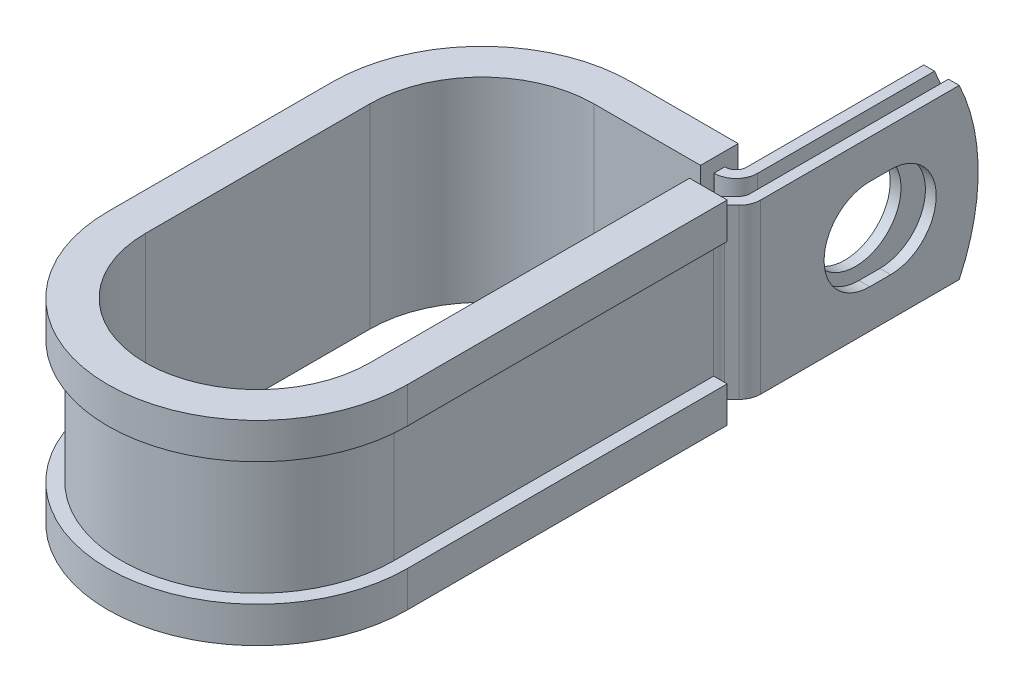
from build123d import *

# Parameters (mm, degrees)
EXTRUDE_THIN1_DEPTH = 9.525
SKETCH2_R           = 5.1562
CUT_EXTRUDE1_DEPTH  = 1.2192
CUT_EXTRUDE2_DEPTH  = 1.2192
CUT_EXTRUDE3_DEPTH  = 51.859060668


with BuildPart() as part:
    # Sketch1 → Extrude-Thin1 (new, symmetric)
    with BuildSketch(Plane(origin=(0, 0, 0), x_dir=(1, 0, 0), z_dir=(0, 1, 0))):
        with BuildLine():
            Line((16.1214698, 38.862), (16.1214698, 14.224))
            ThreePointArc((16.1214698, 14.224), (16.028663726, 13.757432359), (15.764374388, 13.361895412))
            Line((15.764374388, 13.361895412), (14.938190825, 12.535711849))
            ThreePointArc((14.938190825, 12.535711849), (14.409612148, 11.744637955), (14.224, 10.811502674))
            Line((14.224, 10.811502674), (14.224, 0))
            Line((14.224, 0), (14.224, -25.4))
            ThreePointArc((14.224, -25.4), (0, -39.624), (-14.224, -25.4))
            Line((-14.224, -25.4), (-14.224, 0))
            ThreePointArc((-14.224, 0), (-10.057886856, 10.057886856), (0, 14.224))
            Line((0, 14.224), (12.1082698, 14.224))
            ThreePointArc((12.1082698, 14.224), (13.832478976, 14.938190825), (14.5466698, 16.6624))
            Line((14.5466698, 16.6624), (14.5466698, 38.862))
            Line((14.5466698, 38.862), (13.3274698, 38.862))
            Line((13.3274698, 38.862), (13.3274698, 16.6624))
            ThreePointArc((13.3274698, 16.6624), (12.970374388, 15.800295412), (12.1082698, 15.4432))
            Line((12.1082698, 15.4432), (0, 15.4432))
            ThreePointArc((0, 15.4432), (-10.919991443, 10.919991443), (-15.4432, 0))
            Line((-15.4432, 0), (-15.4432, -25.4))
            ThreePointArc((-15.4432, -25.4), (0, -40.8432), (15.4432, -25.4))
            Line((15.4432, -25.4), (15.4432, 0))
            Line((15.4432, 0), (15.4432, 10.811502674))
            ThreePointArc((15.4432, 10.811502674), (15.536006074, 11.278070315), (15.800295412, 11.673607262))
            Line((15.800295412, 11.673607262), (16.626478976, 12.499790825))
            ThreePointArc((16.626478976, 12.499790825), (17.155057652, 13.290864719), (17.3406698, 14.224))
            Line((17.3406698, 14.224), (17.3406698, 38.862))
            Line((17.3406698, 38.862), (16.1214698, 38.862))
        make_face()
    extrude(amount=EXTRUDE_THIN1_DEPTH, both=True)

    # Sketch2 → Cut-Extrude1 (cut)
    with BuildSketch(Plane.ZY.offset(-13.3274698)):
        with Locations((-27.7622, 0)):
            Circle(SKETCH2_R)
    extrude(amount=-CUT_EXTRUDE1_DEPTH, mode=Mode.SUBTRACT)

    # Sketch3 → Cut-Extrude2 (cut)
    with BuildSketch(Plane(origin=(17.3406698, 0, 0), x_dir=(0, 0, -1), z_dir=(1, 0, 0))):
        with BuildLine():
            Line((26.5684, 5.1562), (28.956, 5.1562))
            ThreePointArc((28.956, 5.1562), (34.1122, 0), (28.956, -5.1562))
            Line((28.956, -5.1562), (26.5684, -5.1562))
            ThreePointArc((26.5684, -5.1562), (21.4122, 0), (26.5684, 5.1562))
        make_face()
    extrude(amount=-CUT_EXTRUDE2_DEPTH, mode=Mode.SUBTRACT)

    # Sketch4 → Cut-Extrude3 (cut, through all)
    with BuildSketch(Plane.ZY.offset(-13.3274698)):
        with BuildLine():
            Line((-36.717463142, 9.525), (-38.862, 9.525))
            Line((-38.862, 9.525), (-38.862, -1e-09))
            ThreePointArc((-38.862, -1e-09), (-38.319238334, 4.881717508), (-36.717463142, 9.525))
        make_face()
        with BuildLine():
            ThreePointArc((-36.717463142, -9.525), (-38.319238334, -4.881717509), (-38.862, -1e-09))
            Line((-38.862, -1e-09), (-38.862, -9.525))
            Line((-38.862, -9.525), (-36.717463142, -9.525))
        make_face()
    extrude(amount=-CUT_EXTRUDE3_DEPTH, mode=Mode.SUBTRACT)

    # Sweep1: sweep along a path in Sketch6
    with BuildLine(Plane(origin=(0, 9.525, 0), x_dir=(1, 0, 0), z_dir=(0, 1, 0))) as sweep1_path:
        Line((12.7, 10.811502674), (12.7, 0))
        Line((12.7, 0), (12.7, -25.4))
        ThreePointArc((12.7, -25.4), (0, -38.1), (-12.7, -25.4))
        Line((-12.7, -25.4), (-12.7, 0))
        ThreePointArc((-12.7, 0), (-8.980256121, 8.980256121), (0, 12.7))
        Line((0, 12.7), (12.0574698, 12.7))
    # Sketch5 → Sweep1 (sweep)
    with BuildSketch(Plane(origin=(0, 0, -10.811502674), x_dir=(-1, 0, 0), z_dir=(0, 0, -1))):
        Polygon((-15.4432, 9.525), (-14.224, 9.525), (-14.224, -9.525), (-15.4432, -9.525), (-15.4432, -6.985), (-16.9672, -6.985), (-16.9672, -11.049), (-12.7, -11.049), (-12.7, 11.049), (-16.9672, 11.049), (-16.9672, 6.985), (-15.4432, 6.985), align=None)
    sweep(path=sweep1_path.line)


solid = part.part
